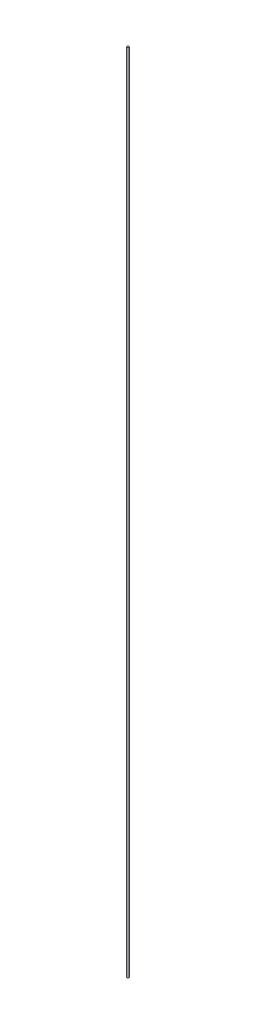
from build123d import *

# Parameters (mm, degrees)
SKETCH1_R           = 0.25
BOSS_EXTRUDE1_DEPTH = 197


with BuildPart() as part:
    # Sketch1 → Boss-Extrude1 (new body)
    with BuildSketch(Plane(origin=(0, 0, 0), x_dir=(1, 0, 0), z_dir=(0, 1, 0))):
        with Locations(Location((0, 0, 0), (0, 0, 270))):
            Circle(SKETCH1_R)
    extrude(amount=BOSS_EXTRUDE1_DEPTH)


solid = part.part
